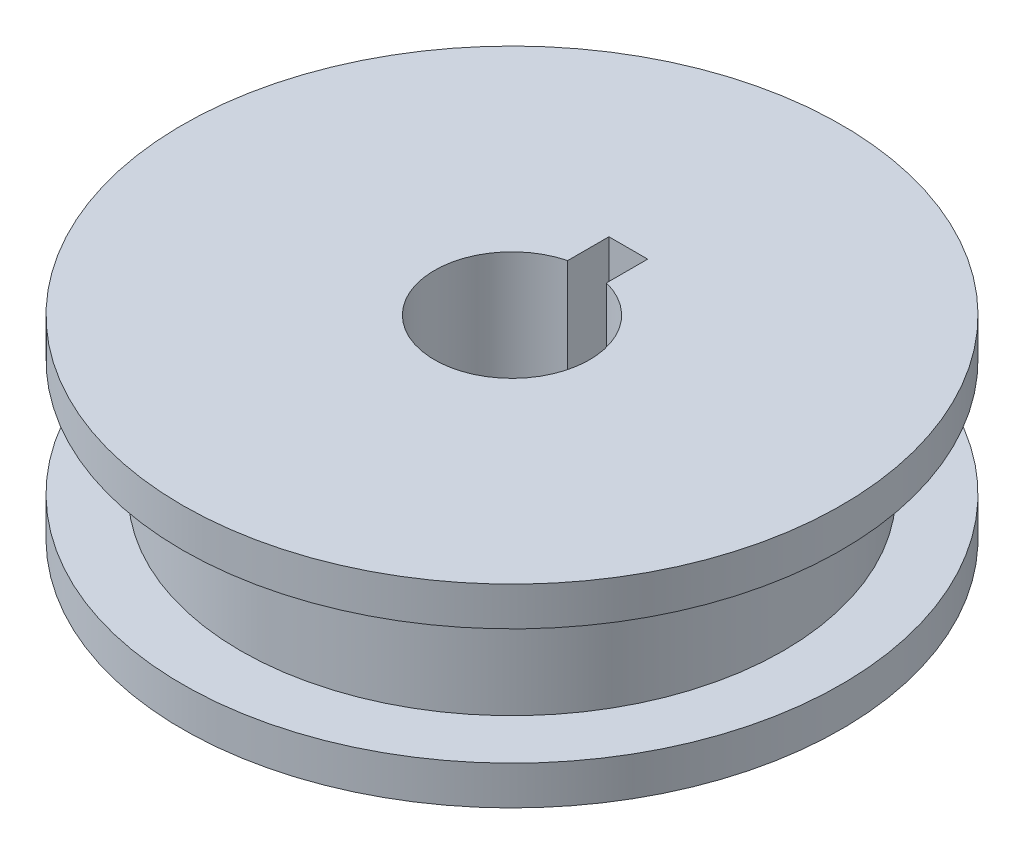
ISO-10303-21;
HEADER;
FILE_DESCRIPTION(('STEP AP214'),'2;1');
FILE_NAME('part.step','',(''),(''),'','','');
FILE_SCHEMA(('AUTOMOTIVE_DESIGN { 1 0 10303 214 1 1 1 1 }'));
ENDSEC;
DATA;
#1=APPLICATION_CONTEXT('core data for automotive mechanical design processes');
#2=APPLICATION_PROTOCOL_DEFINITION('international standard','automotive_design',2000,#1);
#3=PRODUCT_CONTEXT('',#1,'mechanical');
#4=PRODUCT('Part','Part','',(#3));
#5=PRODUCT_RELATED_PRODUCT_CATEGORY('part','',(#4));
#6=PRODUCT_DEFINITION_FORMATION('','',#4);
#7=PRODUCT_DEFINITION_CONTEXT('part definition',#1,'design');
#8=PRODUCT_DEFINITION('design','',#6,#7);
#9=PRODUCT_DEFINITION_SHAPE('','',#8);
#10=(LENGTH_UNIT() NAMED_UNIT(*) SI_UNIT(.MILLI.,.METRE.));
#11=(NAMED_UNIT(*) PLANE_ANGLE_UNIT() SI_UNIT($,.RADIAN.));
#12=(NAMED_UNIT(*) SI_UNIT($,.STERADIAN.) SOLID_ANGLE_UNIT());
#13=UNCERTAINTY_MEASURE_WITH_UNIT(LENGTH_MEASURE(1.E-05),#10,'distance_accuracy_value','');
#14=(GEOMETRIC_REPRESENTATION_CONTEXT(3) GLOBAL_UNCERTAINTY_ASSIGNED_CONTEXT((#13)) GLOBAL_UNIT_ASSIGNED_CONTEXT((#10,
#11,#12)) REPRESENTATION_CONTEXT('',''));
#15=CARTESIAN_POINT('',(0.,0.,0.));
#16=DIRECTION('',(0.,0.,1.));
#17=DIRECTION('',(1.,0.,0.));
#18=AXIS2_PLACEMENT_3D('',#15,#16,#17);
#19=CARTESIAN_POINT('',(0.,-9.525,0.));
#20=DIRECTION('',(0.,-1.,0.));
#21=DIRECTION('',(0.,0.,-1.));
#22=AXIS2_PLACEMENT_3D('',#19,#20,#21);
#23=PLANE('',#22);
#24=DIRECTION('',(0.,0.,1.));
#25=VECTOR('',#24,1.);
#26=CARTESIAN_POINT('',(-1.5875,-9.525,-6.35));
#27=LINE('',#26,#25);
#28=CARTESIAN_POINT('',(-1.5875,-9.525,-9.525));
#29=VERTEX_POINT('',#28);
#30=CARTESIAN_POINT('',(-1.5875,-9.525,-6.14836106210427));
#31=VERTEX_POINT('',#30);
#32=EDGE_CURVE('E84',#29,#31,#27,.T.);
#33=ORIENTED_EDGE('',*,*,#32,.T.);
#34=CARTESIAN_POINT('',(0.,-9.525,0.));
#35=DIRECTION('',(0.,-1.,0.));
#36=DIRECTION('',(0.,0.,-1.));
#37=AXIS2_PLACEMENT_3D('',#34,#35,#36);
#38=CIRCLE('',#37,6.35);
#39=CARTESIAN_POINT('',(1.5875,-9.525,-6.14836106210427));
#40=VERTEX_POINT('',#39);
#41=EDGE_CURVE('E94',#31,#40,#38,.F.);
#42=ORIENTED_EDGE('',*,*,#41,.T.);
#43=DIRECTION('',(0.,0.,-1.));
#44=VECTOR('',#43,1.);
#45=CARTESIAN_POINT('',(1.5875,-9.525,-6.14836106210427));
#46=LINE('',#45,#44);
#47=CARTESIAN_POINT('',(1.5875,-9.525,-9.525));
#48=VERTEX_POINT('',#47);
#49=EDGE_CURVE('E49',#40,#48,#46,.T.);
#50=ORIENTED_EDGE('',*,*,#49,.T.);
#51=DIRECTION('',(-1.,0.,0.));
#52=VECTOR('',#51,1.);
#53=CARTESIAN_POINT('',(-1.5875,-9.525,-9.525));
#54=LINE('',#53,#52);
#55=EDGE_CURVE('E87',#48,#29,#54,.T.);
#56=ORIENTED_EDGE('',*,*,#55,.T.);
#57=EDGE_LOOP('',(#33,#42,#50,#56));
#58=FACE_BOUND('',#57,.T.);
#59=CARTESIAN_POINT('',(0.,-9.525,0.));
#60=DIRECTION('',(0.,-1.,0.));
#61=DIRECTION('',(0.,0.,-1.));
#62=AXIS2_PLACEMENT_3D('',#59,#60,#61);
#63=CIRCLE('',#62,26.9875);
#64=CARTESIAN_POINT('',(0.,-9.525,-26.9875));
#65=VERTEX_POINT('',#64);
#66=EDGE_CURVE('E114',#65,#65,#63,.T.);
#67=ORIENTED_EDGE('',*,*,#66,.T.);
#68=EDGE_LOOP('',(#67));
#69=FACE_BOUND('',#68,.T.);
#70=ADVANCED_FACE('F33',(#58,#69),#23,.T.);
#71=CARTESIAN_POINT('',(0.,6.35,0.));
#72=DIRECTION('',(0.,1.,0.));
#73=DIRECTION('',(0.,0.,1.));
#74=AXIS2_PLACEMENT_3D('',#71,#72,#73);
#75=PLANE('',#74);
#76=DIRECTION('',(0.,0.,1.));
#77=VECTOR('',#76,1.);
#78=CARTESIAN_POINT('',(-1.5875,6.35,-6.35));
#79=LINE('',#78,#77);
#80=CARTESIAN_POINT('',(-1.5875,6.35,-9.525));
#81=VERTEX_POINT('',#80);
#82=CARTESIAN_POINT('',(-1.5875,6.35,-6.14836106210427));
#83=VERTEX_POINT('',#82);
#84=EDGE_CURVE('E95',#81,#83,#79,.T.);
#85=ORIENTED_EDGE('',*,*,#84,.F.);
#86=DIRECTION('',(-1.,0.,0.));
#87=VECTOR('',#86,1.);
#88=CARTESIAN_POINT('',(-1.5875,6.35,-9.525));
#89=LINE('',#88,#87);
#90=CARTESIAN_POINT('',(1.5875,6.35,-9.525));
#91=VERTEX_POINT('',#90);
#92=EDGE_CURVE('E97',#91,#81,#89,.T.);
#93=ORIENTED_EDGE('',*,*,#92,.F.);
#94=DIRECTION('',(0.,0.,-1.));
#95=VECTOR('',#94,1.);
#96=CARTESIAN_POINT('',(1.5875,6.35,-6.35));
#97=LINE('',#96,#95);
#98=CARTESIAN_POINT('',(1.5875,6.35,-6.14836106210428));
#99=VERTEX_POINT('',#98);
#100=EDGE_CURVE('E79',#99,#91,#97,.T.);
#101=ORIENTED_EDGE('',*,*,#100,.F.);
#102=CARTESIAN_POINT('',(0.,6.35,0.));
#103=DIRECTION('',(0.,1.,0.));
#104=DIRECTION('',(0.,0.,1.));
#105=AXIS2_PLACEMENT_3D('',#102,#103,#104);
#106=CIRCLE('',#105,6.35);
#107=EDGE_CURVE('E37',#99,#83,#106,.F.);
#108=ORIENTED_EDGE('',*,*,#107,.T.);
#109=EDGE_LOOP('',(#85,#93,#101,#108));
#110=FACE_BOUND('',#109,.T.);
#111=CARTESIAN_POINT('',(0.,6.35,0.));
#112=DIRECTION('',(0.,1.,0.));
#113=DIRECTION('',(0.,0.,1.));
#114=AXIS2_PLACEMENT_3D('',#111,#112,#113);
#115=CIRCLE('',#114,26.9875);
#116=CARTESIAN_POINT('',(0.,6.35,26.9875));
#117=VERTEX_POINT('',#116);
#118=EDGE_CURVE('E108',#117,#117,#115,.T.);
#119=ORIENTED_EDGE('',*,*,#118,.T.);
#120=EDGE_LOOP('',(#119));
#121=FACE_BOUND('',#120,.T.);
#122=ADVANCED_FACE('F137',(#110,#121),#75,.T.);
#123=CARTESIAN_POINT('',(0.,-6.35,0.));
#124=DIRECTION('',(0.,1.,0.));
#125=DIRECTION('',(0.,0.,1.));
#126=AXIS2_PLACEMENT_3D('',#123,#124,#125);
#127=CYLINDRICAL_SURFACE('',#126,22.225);
#128=CARTESIAN_POINT('',(0.,-6.35,0.));
#129=DIRECTION('',(0.,-1.,0.));
#130=DIRECTION('',(0.,0.,-1.));
#131=AXIS2_PLACEMENT_3D('',#128,#129,#130);
#132=CIRCLE('',#131,22.225);
#133=CARTESIAN_POINT('',(0.,-6.35,-22.225));
#134=VERTEX_POINT('',#133);
#135=EDGE_CURVE('E42',#134,#134,#132,.F.);
#136=ORIENTED_EDGE('',*,*,#135,.T.);
#137=EDGE_LOOP('',(#136));
#138=FACE_BOUND('',#137,.T.);
#139=CARTESIAN_POINT('',(0.,3.175,0.));
#140=DIRECTION('',(0.,1.,0.));
#141=DIRECTION('',(0.,0.,1.));
#142=AXIS2_PLACEMENT_3D('',#139,#140,#141);
#143=CIRCLE('',#142,22.225);
#144=CARTESIAN_POINT('',(0.,3.175,22.225));
#145=VERTEX_POINT('',#144);
#146=EDGE_CURVE('E11',#145,#145,#143,.T.);
#147=ORIENTED_EDGE('',*,*,#146,.F.);
#148=EDGE_LOOP('',(#147));
#149=FACE_BOUND('',#148,.T.);
#150=ADVANCED_FACE('F35',(#138,#149),#127,.T.);
#151=CARTESIAN_POINT('',(0.,-9.525,0.));
#152=DIRECTION('',(0.,1.,0.));
#153=DIRECTION('',(0.,0.,1.));
#154=AXIS2_PLACEMENT_3D('',#151,#152,#153);
#155=CYLINDRICAL_SURFACE('',#154,26.9875);
#156=ORIENTED_EDGE('',*,*,#66,.F.);
#157=EDGE_LOOP('',(#156));
#158=FACE_BOUND('',#157,.T.);
#159=CARTESIAN_POINT('',(0.,-6.35,0.));
#160=DIRECTION('',(0.,-1.,0.));
#161=DIRECTION('',(0.,0.,-1.));
#162=AXIS2_PLACEMENT_3D('',#159,#160,#161);
#163=CIRCLE('',#162,26.9875);
#164=CARTESIAN_POINT('',(0.,-6.35,-26.9875));
#165=VERTEX_POINT('',#164);
#166=EDGE_CURVE('E111',#165,#165,#163,.T.);
#167=ORIENTED_EDGE('',*,*,#166,.T.);
#168=EDGE_LOOP('',(#167));
#169=FACE_BOUND('',#168,.T.);
#170=ADVANCED_FACE('F128',(#158,#169),#155,.T.);
#171=CARTESIAN_POINT('',(0.,-6.35,0.));
#172=DIRECTION('',(0.,-1.,0.));
#173=DIRECTION('',(0.,0.,-1.));
#174=AXIS2_PLACEMENT_3D('',#171,#172,#173);
#175=PLANE('',#174);
#176=ORIENTED_EDGE('',*,*,#135,.F.);
#177=EDGE_LOOP('',(#176));
#178=FACE_BOUND('',#177,.T.);
#179=ORIENTED_EDGE('',*,*,#166,.F.);
#180=EDGE_LOOP('',(#179));
#181=FACE_BOUND('',#180,.T.);
#182=ADVANCED_FACE('F124',(#178,#181),#175,.F.);
#183=CARTESIAN_POINT('',(0.,6.35,0.));
#184=DIRECTION('',(0.,-1.,0.));
#185=DIRECTION('',(0.,0.,-1.));
#186=AXIS2_PLACEMENT_3D('',#183,#184,#185);
#187=CYLINDRICAL_SURFACE('',#186,26.9875);
#188=ORIENTED_EDGE('',*,*,#118,.F.);
#189=EDGE_LOOP('',(#188));
#190=FACE_BOUND('',#189,.T.);
#191=CARTESIAN_POINT('',(0.,3.175,0.));
#192=DIRECTION('',(0.,1.,0.));
#193=DIRECTION('',(0.,0.,1.));
#194=AXIS2_PLACEMENT_3D('',#191,#192,#193);
#195=CIRCLE('',#194,26.9875);
#196=CARTESIAN_POINT('',(0.,3.175,26.9875));
#197=VERTEX_POINT('',#196);
#198=EDGE_CURVE('E107',#197,#197,#195,.T.);
#199=ORIENTED_EDGE('',*,*,#198,.T.);
#200=EDGE_LOOP('',(#199));
#201=FACE_BOUND('',#200,.T.);
#202=ADVANCED_FACE('F127',(#190,#201),#187,.T.);
#203=CARTESIAN_POINT('',(0.,3.175,0.));
#204=DIRECTION('',(0.,1.,0.));
#205=DIRECTION('',(0.,0.,1.));
#206=AXIS2_PLACEMENT_3D('',#203,#204,#205);
#207=PLANE('',#206);
#208=ORIENTED_EDGE('',*,*,#146,.T.);
#209=EDGE_LOOP('',(#208));
#210=FACE_BOUND('',#209,.T.);
#211=ORIENTED_EDGE('',*,*,#198,.F.);
#212=EDGE_LOOP('',(#211));
#213=FACE_BOUND('',#212,.T.);
#214=ADVANCED_FACE('F149',(#210,#213),#207,.F.);
#215=CARTESIAN_POINT('',(0.,31.496,0.));
#216=DIRECTION('',(0.,-1.,0.));
#217=DIRECTION('',(0.,0.,-1.));
#218=AXIS2_PLACEMENT_3D('',#215,#216,#217);
#219=CYLINDRICAL_SURFACE('',#218,6.35);
#220=DIRECTION('',(0.,1.,0.));
#221=VECTOR('',#220,1.);
#222=CARTESIAN_POINT('',(-1.5875,-9.525,-6.14836106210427));
#223=LINE('',#222,#221);
#224=EDGE_CURVE('E58',#31,#83,#223,.T.);
#225=ORIENTED_EDGE('',*,*,#224,.T.);
#226=ORIENTED_EDGE('',*,*,#107,.F.);
#227=DIRECTION('',(0.,1.,0.));
#228=VECTOR('',#227,1.);
#229=CARTESIAN_POINT('',(1.5875,-9.525,-6.14836106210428));
#230=LINE('',#229,#228);
#231=EDGE_CURVE('E74',#40,#99,#230,.T.);
#232=ORIENTED_EDGE('',*,*,#231,.F.);
#233=ORIENTED_EDGE('',*,*,#41,.F.);
#234=EDGE_LOOP('',(#225,#226,#232,#233));
#235=FACE_BOUND('',#234,.T.);
#236=ADVANCED_FACE('F152',(#235),#219,.F.);
#237=CARTESIAN_POINT('',(-1.5875,-9.525,-6.35));
#238=DIRECTION('',(-1.,0.,0.));
#239=DIRECTION('',(0.,0.,1.));
#240=AXIS2_PLACEMENT_3D('',#237,#238,#239);
#241=PLANE('',#240);
#242=ORIENTED_EDGE('',*,*,#84,.T.);
#243=ORIENTED_EDGE('',*,*,#224,.F.);
#244=ORIENTED_EDGE('',*,*,#32,.F.);
#245=DIRECTION('',(0.,1.,0.));
#246=VECTOR('',#245,1.);
#247=CARTESIAN_POINT('',(-1.5875,-9.525,-9.525));
#248=LINE('',#247,#246);
#249=EDGE_CURVE('E83',#29,#81,#248,.T.);
#250=ORIENTED_EDGE('',*,*,#249,.T.);
#251=EDGE_LOOP('',(#242,#243,#244,#250));
#252=FACE_BOUND('',#251,.T.);
#253=ADVANCED_FACE('F157',(#252),#241,.F.);
#254=CARTESIAN_POINT('',(-1.5875,-9.525,-9.525));
#255=DIRECTION('',(0.,0.,-1.));
#256=DIRECTION('',(-1.,0.,0.));
#257=AXIS2_PLACEMENT_3D('',#254,#255,#256);
#258=PLANE('',#257);
#259=ORIENTED_EDGE('',*,*,#92,.T.);
#260=ORIENTED_EDGE('',*,*,#249,.F.);
#261=ORIENTED_EDGE('',*,*,#55,.F.);
#262=DIRECTION('',(0.,1.,0.));
#263=VECTOR('',#262,1.);
#264=CARTESIAN_POINT('',(1.5875,-9.525,-9.525));
#265=LINE('',#264,#263);
#266=EDGE_CURVE('E76',#48,#91,#265,.T.);
#267=ORIENTED_EDGE('',*,*,#266,.T.);
#268=EDGE_LOOP('',(#259,#260,#261,#267));
#269=FACE_BOUND('',#268,.T.);
#270=ADVANCED_FACE('F88',(#269),#258,.F.);
#271=CARTESIAN_POINT('',(1.5875,-9.525,-6.35));
#272=DIRECTION('',(1.,0.,0.));
#273=DIRECTION('',(0.,0.,-1.));
#274=AXIS2_PLACEMENT_3D('',#271,#272,#273);
#275=PLANE('',#274);
#276=ORIENTED_EDGE('',*,*,#100,.T.);
#277=ORIENTED_EDGE('',*,*,#266,.F.);
#278=ORIENTED_EDGE('',*,*,#49,.F.);
#279=ORIENTED_EDGE('',*,*,#231,.T.);
#280=EDGE_LOOP('',(#276,#277,#278,#279));
#281=FACE_BOUND('',#280,.T.);
#282=ADVANCED_FACE('F78',(#281),#275,.F.);
#283=CLOSED_SHELL('',(#70,#122,#150,#170,#182,#202,#214,#236,#253,#270,#282));
#284=MANIFOLD_SOLID_BREP('B2',#283);
#285=ADVANCED_BREP_SHAPE_REPRESENTATION('',(#18,#284),#14);
#286=SHAPE_DEFINITION_REPRESENTATION(#9,#285);
ENDSEC;
END-ISO-10303-21;
